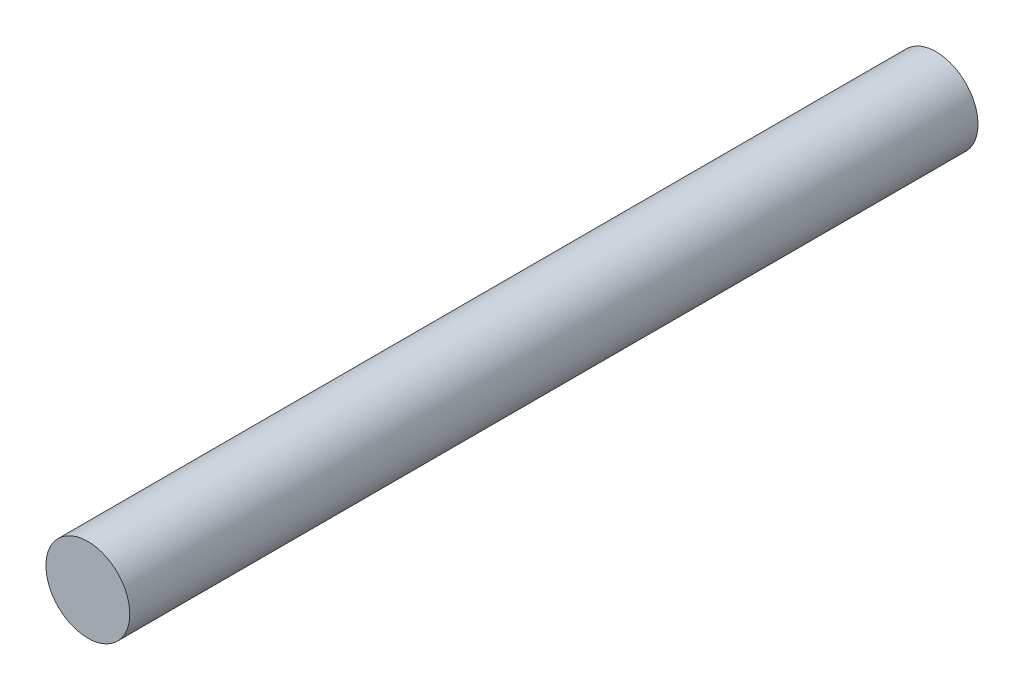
ISO-10303-21;
HEADER;
FILE_DESCRIPTION(('STEP AP214'),'2;1');
FILE_NAME('part.step','',(''),(''),'','','');
FILE_SCHEMA(('AUTOMOTIVE_DESIGN { 1 0 10303 214 1 1 1 1 }'));
ENDSEC;
DATA;
#1=APPLICATION_CONTEXT('core data for automotive mechanical design processes');
#2=APPLICATION_PROTOCOL_DEFINITION('international standard','automotive_design',2000,#1);
#3=PRODUCT_CONTEXT('',#1,'mechanical');
#4=PRODUCT('Part','Part','',(#3));
#5=PRODUCT_RELATED_PRODUCT_CATEGORY('part','',(#4));
#6=PRODUCT_DEFINITION_FORMATION('','',#4);
#7=PRODUCT_DEFINITION_CONTEXT('part definition',#1,'design');
#8=PRODUCT_DEFINITION('design','',#6,#7);
#9=PRODUCT_DEFINITION_SHAPE('','',#8);
#10=(LENGTH_UNIT() NAMED_UNIT(*) SI_UNIT(.MILLI.,.METRE.));
#11=(NAMED_UNIT(*) PLANE_ANGLE_UNIT() SI_UNIT($,.RADIAN.));
#12=(NAMED_UNIT(*) SI_UNIT($,.STERADIAN.) SOLID_ANGLE_UNIT());
#13=UNCERTAINTY_MEASURE_WITH_UNIT(LENGTH_MEASURE(1.E-05),#10,'distance_accuracy_value','');
#14=(GEOMETRIC_REPRESENTATION_CONTEXT(3) GLOBAL_UNCERTAINTY_ASSIGNED_CONTEXT((#13)) GLOBAL_UNIT_ASSIGNED_CONTEXT((#10,
#11,#12)) REPRESENTATION_CONTEXT('',''));
#15=CARTESIAN_POINT('',(0.,0.,0.));
#16=DIRECTION('',(0.,0.,1.));
#17=DIRECTION('',(1.,0.,0.));
#18=AXIS2_PLACEMENT_3D('',#15,#16,#17);
#19=CARTESIAN_POINT('',(0.,0.,58.3184));
#20=DIRECTION('',(0.,0.,-1.));
#21=DIRECTION('',(-1.,0.,0.));
#22=AXIS2_PLACEMENT_3D('',#19,#20,#21);
#23=CYLINDRICAL_SURFACE('',#22,2.8829);
#24=CARTESIAN_POINT('',(0.,0.,58.3184));
#25=DIRECTION('',(0.,0.,1.));
#26=DIRECTION('',(1.,0.,0.));
#27=AXIS2_PLACEMENT_3D('',#24,#25,#26);
#28=CIRCLE('',#27,2.8829);
#29=CARTESIAN_POINT('',(2.8829,0.,58.3184));
#30=VERTEX_POINT('',#29);
#31=EDGE_CURVE('E10',#30,#30,#28,.T.);
#32=ORIENTED_EDGE('',*,*,#31,.F.);
#33=EDGE_LOOP('',(#32));
#34=FACE_BOUND('',#33,.T.);
#35=CARTESIAN_POINT('',(0.,0.,0.));
#36=DIRECTION('',(0.,0.,1.));
#37=DIRECTION('',(1.,0.,0.));
#38=AXIS2_PLACEMENT_3D('',#35,#36,#37);
#39=CIRCLE('',#38,2.8829);
#40=CARTESIAN_POINT('',(2.8829,0.,0.));
#41=VERTEX_POINT('',#40);
#42=EDGE_CURVE('E33',#41,#41,#39,.T.);
#43=ORIENTED_EDGE('',*,*,#42,.T.);
#44=EDGE_LOOP('',(#43));
#45=FACE_BOUND('',#44,.T.);
#46=ADVANCED_FACE('F30',(#34,#45),#23,.T.);
#47=CARTESIAN_POINT('',(0.,0.,58.3184));
#48=DIRECTION('',(0.,0.,1.));
#49=DIRECTION('',(1.,0.,0.));
#50=AXIS2_PLACEMENT_3D('',#47,#48,#49);
#51=PLANE('',#50);
#52=ORIENTED_EDGE('',*,*,#31,.T.);
#53=EDGE_LOOP('',(#52));
#54=FACE_BOUND('',#53,.T.);
#55=ADVANCED_FACE('F45',(#54),#51,.T.);
#56=CARTESIAN_POINT('',(0.,0.,0.));
#57=DIRECTION('',(0.,0.,1.));
#58=DIRECTION('',(1.,0.,0.));
#59=AXIS2_PLACEMENT_3D('',#56,#57,#58);
#60=PLANE('',#59);
#61=ORIENTED_EDGE('',*,*,#42,.F.);
#62=EDGE_LOOP('',(#61));
#63=FACE_BOUND('',#62,.T.);
#64=ADVANCED_FACE('F43',(#63),#60,.F.);
#65=CLOSED_SHELL('',(#46,#55,#64));
#66=MANIFOLD_SOLID_BREP('B2',#65);
#67=ADVANCED_BREP_SHAPE_REPRESENTATION('',(#18,#66),#14);
#68=SHAPE_DEFINITION_REPRESENTATION(#9,#67);
ENDSEC;
END-ISO-10303-21;
